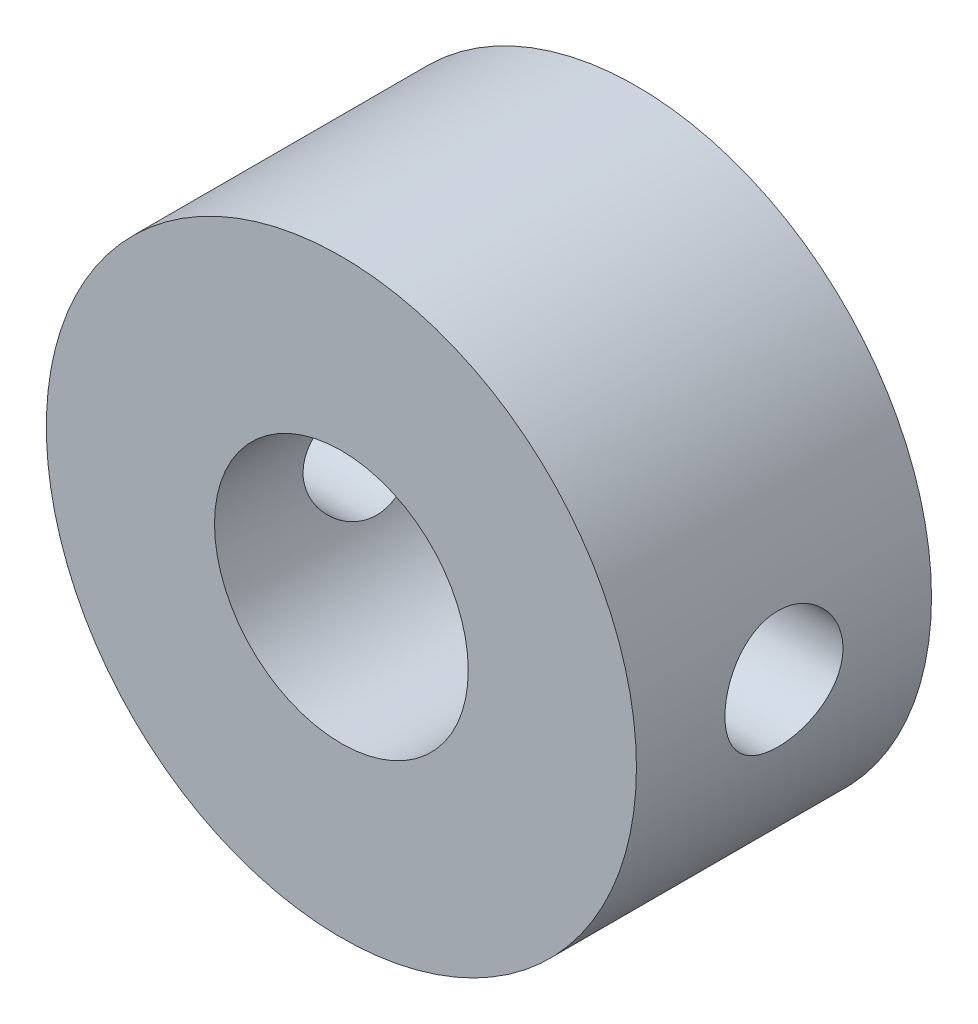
from build123d import *

# Parameters (mm, degrees)
ESQUISSE1_R                  = 5
ESQUISSE1_R_2                = 2.15
BOSS_EXTRU_1_DEPTH           = 5
ENL_V_MAT_EXTRU_1_DEPTH      = 10
ENL_V_MAT_EXTRU_1_DEPTH_BACK = 10
ESQUISSE2_R                  = 1


with BuildPart() as part:
    # Esquisse1 → Boss.-Extru.1 (new body)
    with BuildSketch(Plane.XY):
        Circle(ESQUISSE1_R)
        Circle(ESQUISSE1_R_2, mode=Mode.SUBTRACT)
    extrude(amount=BOSS_EXTRU_1_DEPTH)

    # Esquisse2 → Enl_v. mat.-Extru.1 (cut, two sides: drawn at the far end of the back side and taken through both)
    with BuildSketch(Plane(origin=(0, 0, 0), x_dir=(0, 0, -1), z_dir=(1, 0, 0)).offset(-ENL_V_MAT_EXTRU_1_DEPTH_BACK)):
        with Locations(Location((-2.5, 0, 0), (0, 0, 180))):
            Circle(ESQUISSE2_R)
    extrude(amount=ENL_V_MAT_EXTRU_1_DEPTH + ENL_V_MAT_EXTRU_1_DEPTH_BACK, mode=Mode.SUBTRACT)


solid = part.part
